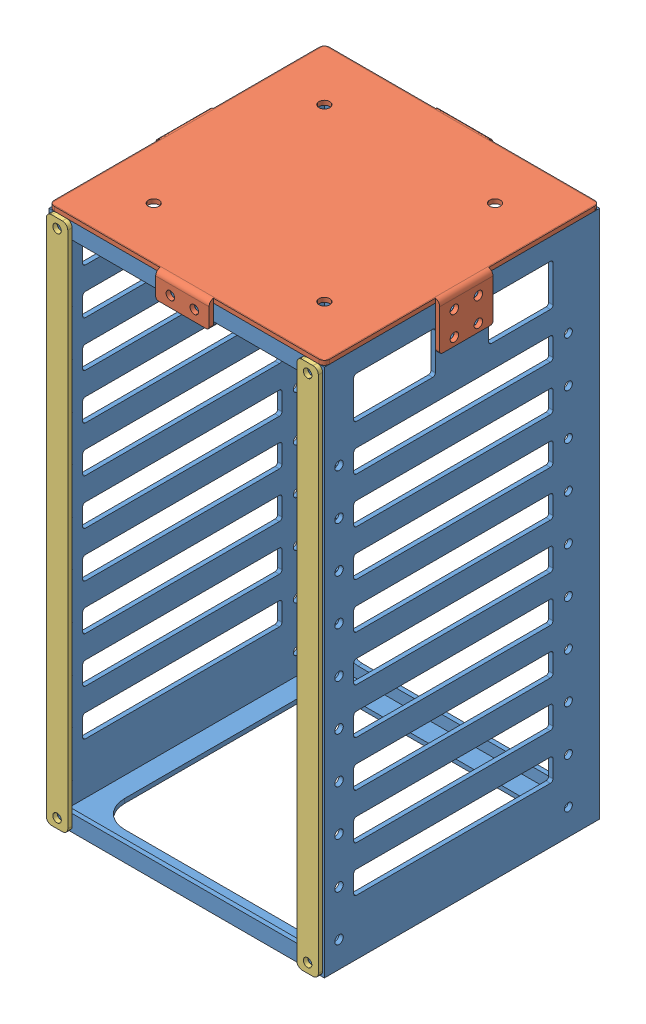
SolidWorks assembly EBayAssemblyMANUFACTURED.SLDASM, configuration Default (file format 15000). Lengths in mm.
Overall size (106.52 200 106.52).
4 component instances, 3 part files, 10 mates.
Components (placement in the parent):
- MainEnclosure-1: MainEnclosure.SLDPRT [Default] at (29.9385 45.6287 215.0432) size (103.26 198.37 103.26)
- EnclosureLid-1: EnclosureLid.SLDPRT [Default] at (29.9385 243.9987 215.0432) size (106.52 17.58 106.52)
- EnclosureFrontPanel-1: EnclosureFrontPanel.SLDPRT [Default] at (-17.0363 45.6287 267.4882) x (1 0.000052 0) z (0 0 1) size (8.07 198.37 1.63)
- EnclosureFrontPanel-2: EnclosureFrontPanel.SLDPRT [Default] at (76.9237 45.6287 267.4882) x (1 0.000052 0) z (0 0 1) size (8.07 198.37 1.63)
Mates (geometry in assembly coordinates):
- Coincident3: coincident anti-aligned: plane of MainEnclosure-1 through (29.9385 243.9987 215.0432) normal (0 1 0); plane of EnclosureLid-1 through (29.9385 243.9987 215.0432) normal (0 -1 0)
- Coincident26: coincident: line of MainEnclosure-1 through (-21.6915 243.9987 266.6732) axis (1 0 0); plane of EnclosureLid-1 through (-21.6915 245.6287 266.6732) normal (0 0 1)
- Coincident4: coincident anti-aligned: plane of MainEnclosure-1 through (81.5685 47.2587 266.6732) normal (1 0 0); plane of EnclosureLid-1 through (81.5685 228.1787 224.9132) normal (-1 0 0)
- Coincident6: coincident: plane of MainEnclosure-1 through (-21.6915 47.2587 266.6732) normal (0 0 1); plane of EnclosureFrontPanel-1 through (-21.0817 243.9985 266.6732) normal (0 0 -1)
- Concentric6: concentric: circle of MainEnclosure-1; circle of EnclosureFrontPanel-2
- Concentric5: concentric: circle of MainEnclosure-1; circle of EnclosureFrontPanel-1
- Concentric8: concentric: circle of MainEnclosure-1; circle of EnclosureFrontPanel-2
- Coincident32: coincident: plane of MainEnclosure-1 through (-21.6915 47.2587 266.6732) normal (0 0 1); plane of EnclosureFrontPanel-2 through (72.8783 243.9985 266.6732) normal (0 0 -1)
- Concentric7: concentric: circle of MainEnclosure-1; circle of EnclosureFrontPanel-1
- Concentric16: concentric: circle of MainEnclosure-1; circle of EnclosureLid-1
